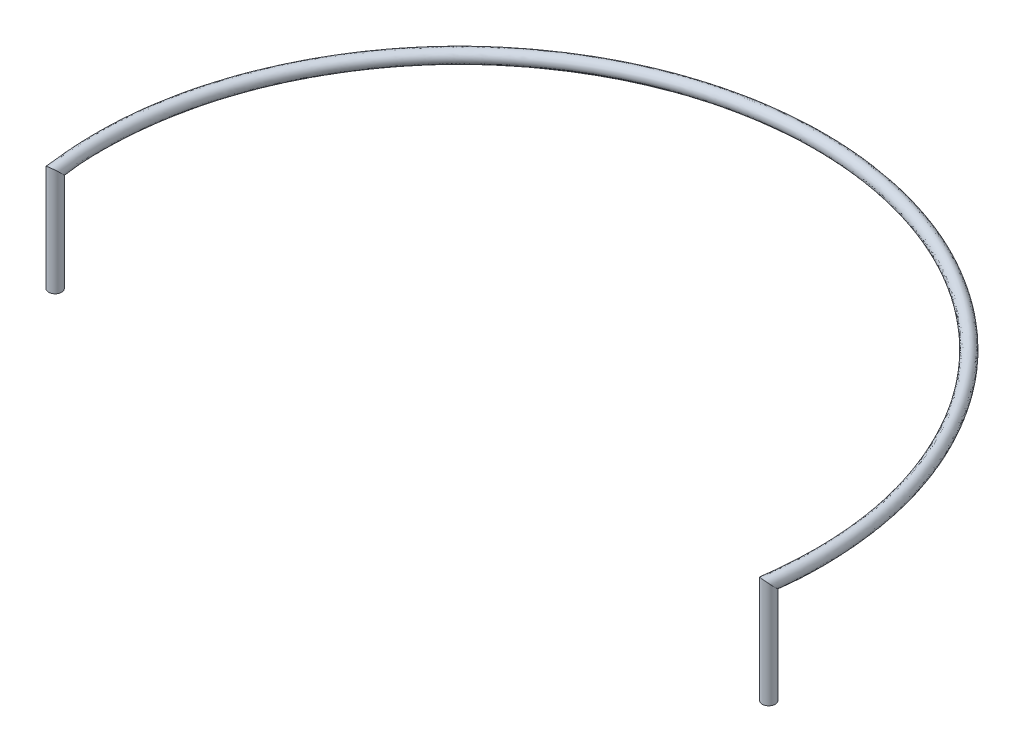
ISO-10303-21;
HEADER;
FILE_DESCRIPTION(('STEP AP214'),'2;1');
FILE_NAME('part.step','',(''),(''),'','','');
FILE_SCHEMA(('AUTOMOTIVE_DESIGN { 1 0 10303 214 1 1 1 1 }'));
ENDSEC;
DATA;
#1=APPLICATION_CONTEXT('core data for automotive mechanical design processes');
#2=APPLICATION_PROTOCOL_DEFINITION('international standard','automotive_design',2000,#1);
#3=PRODUCT_CONTEXT('',#1,'mechanical');
#4=PRODUCT('Part','Part','',(#3));
#5=PRODUCT_RELATED_PRODUCT_CATEGORY('part','',(#4));
#6=PRODUCT_DEFINITION_FORMATION('','',#4);
#7=PRODUCT_DEFINITION_CONTEXT('part definition',#1,'design');
#8=PRODUCT_DEFINITION('design','',#6,#7);
#9=PRODUCT_DEFINITION_SHAPE('','',#8);
#10=(LENGTH_UNIT() NAMED_UNIT(*) SI_UNIT(.MILLI.,.METRE.));
#11=(NAMED_UNIT(*) PLANE_ANGLE_UNIT() SI_UNIT($,.RADIAN.));
#12=(NAMED_UNIT(*) SI_UNIT($,.STERADIAN.) SOLID_ANGLE_UNIT());
#13=UNCERTAINTY_MEASURE_WITH_UNIT(LENGTH_MEASURE(1.E-05),#10,'distance_accuracy_value','');
#14=(GEOMETRIC_REPRESENTATION_CONTEXT(3) GLOBAL_UNCERTAINTY_ASSIGNED_CONTEXT((#13)) GLOBAL_UNIT_ASSIGNED_CONTEXT((#10,
#11,#12)) REPRESENTATION_CONTEXT('',''));
#15=CARTESIAN_POINT('',(0.,0.,0.));
#16=DIRECTION('',(0.,0.,1.));
#17=DIRECTION('',(1.,0.,0.));
#18=AXIS2_PLACEMENT_3D('',#15,#16,#17);
#19=CARTESIAN_POINT('',(-7.,0.360058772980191,0.));
#20=DIRECTION('',(0.,-1.,0.));
#21=DIRECTION('',(0.,0.,-1.));
#22=AXIS2_PLACEMENT_3D('',#19,#20,#21);
#23=CYLINDRICAL_SURFACE('',#22,0.127299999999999);
#24=CARTESIAN_POINT('',(-7.,-2.,0.));
#25=DIRECTION('',(0.,1.,0.));
#26=DIRECTION('',(0.,0.,1.));
#27=AXIS2_PLACEMENT_3D('',#24,#25,#26);
#28=CIRCLE('',#27,0.127299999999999);
#29=CARTESIAN_POINT('',(-7.,-2.,0.127300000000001));
#30=VERTEX_POINT('',#29);
#31=EDGE_CURVE('E42',#30,#30,#28,.T.);
#32=ORIENTED_EDGE('',*,*,#31,.T.);
#33=EDGE_LOOP('',(#32));
#34=FACE_BOUND('',#33,.T.);
#35=CARTESIAN_POINT('',(-7.,0.,0.));
#36=DIRECTION('',(-0.0938637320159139,0.707106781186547,-0.700849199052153));
#37=DIRECTION('',(-0.0938637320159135,-0.707106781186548,-0.700849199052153));
#38=AXIS2_PLACEMENT_3D('',#35,#36,#37);
#39=ELLIPSE('',#38,0.180029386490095,0.127299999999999);
#40=CARTESIAN_POINT('',(-7.0168982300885,-0.127299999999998,-0.126173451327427));
#41=VERTEX_POINT('',#40);
#42=EDGE_CURVE('E11',#41,#41,#39,.T.);
#43=ORIENTED_EDGE('',*,*,#42,.F.);
#44=EDGE_LOOP('',(#43));
#45=FACE_BOUND('',#44,.T.);
#46=ADVANCED_FACE('F36',(#34,#45),#23,.T.);
#47=CARTESIAN_POINT('',(-7.,-2.,0.));
#48=DIRECTION('',(0.,1.,0.));
#49=DIRECTION('',(0.,0.,1.));
#50=AXIS2_PLACEMENT_3D('',#47,#48,#49);
#51=PLANE('',#50);
#52=ORIENTED_EDGE('',*,*,#31,.F.);
#53=EDGE_LOOP('',(#52));
#54=FACE_BOUND('',#53,.T.);
#55=ADVANCED_FACE('F75',(#54),#51,.F.);
#56=CARTESIAN_POINT('',(-7.0168982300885,-0.127299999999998,-0.126173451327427));
#57=CARTESIAN_POINT('',(-7.07808801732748,-0.127299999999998,-0.583057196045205));
#58=CARTESIAN_POINT('',(-7.07988436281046,-0.127299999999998,-1.51699880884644));
#59=CARTESIAN_POINT('',(-6.82578459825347,-0.127299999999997,-2.96096078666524));
#60=CARTESIAN_POINT('',(-6.22992064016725,-0.127299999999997,-4.37638041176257));
#61=CARTESIAN_POINT('',(-5.3262642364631,-0.127299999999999,-5.66846581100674));
#62=CARTESIAN_POINT('',(-4.14902945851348,-0.127299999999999,-6.71926392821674));
#63=CARTESIAN_POINT('',(-2.80896690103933,-0.127299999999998,-7.47752218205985));
#64=CARTESIAN_POINT('',(-1.4033462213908,-0.127299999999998,-7.90581309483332));
#65=CARTESIAN_POINT('',(0.,-0.127299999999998,-8.04552641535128));
#66=CARTESIAN_POINT('',(1.40334622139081,-0.127299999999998,-7.90581309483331));
#67=CARTESIAN_POINT('',(2.80896690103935,-0.127299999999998,-7.47752218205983));
#68=CARTESIAN_POINT('',(4.14902945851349,-0.127299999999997,-6.71926392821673));
#69=CARTESIAN_POINT('',(5.32626423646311,-0.127299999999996,-5.66846581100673));
#70=CARTESIAN_POINT('',(6.22992064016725,-0.127299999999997,-4.37638041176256));
#71=CARTESIAN_POINT('',(6.82578459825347,-0.127299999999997,-2.96096078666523));
#72=CARTESIAN_POINT('',(7.07988436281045,-0.127299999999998,-1.51699880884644));
#73=CARTESIAN_POINT('',(7.07808801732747,-0.127299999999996,-0.583057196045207));
#74=CARTESIAN_POINT('',(7.01689823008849,-0.127299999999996,-0.126173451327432));
#75=CARTESIAN_POINT('',(-7.26924513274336,-0.127299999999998,-0.0923769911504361));
#76=CARTESIAN_POINT('',(-7.33344792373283,-0.127299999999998,-0.571757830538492));
#77=CARTESIAN_POINT('',(-7.33525755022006,-0.127299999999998,-1.53126582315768));
#78=CARTESIAN_POINT('',(-7.07274588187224,-0.127299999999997,-3.03180183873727));
#79=CARTESIAN_POINT('',(-6.45582386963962,-0.127299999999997,-4.49802939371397));
#80=CARTESIAN_POINT('',(-5.51951469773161,-0.127299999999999,-5.8376220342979));
#81=CARTESIAN_POINT('',(-4.29982868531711,-0.127299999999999,-6.92700582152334));
#82=CARTESIAN_POINT('',(-2.91108137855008,-0.127299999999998,-7.71290163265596));
#83=CARTESIAN_POINT('',(-1.45438736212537,-0.127299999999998,-8.15703335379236));
#84=CARTESIAN_POINT('',(-1.98099879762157E-13,-0.127299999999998,-8.30176005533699));
#85=CARTESIAN_POINT('',(1.45438736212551,-0.127299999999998,-8.15703335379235));
#86=CARTESIAN_POINT('',(2.91108137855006,-0.127299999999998,-7.71290163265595));
#87=CARTESIAN_POINT('',(4.29982868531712,-0.127299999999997,-6.92700582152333));
#88=CARTESIAN_POINT('',(5.51951469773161,-0.127299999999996,-5.83762203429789));
#89=CARTESIAN_POINT('',(6.45582386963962,-0.127299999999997,-4.49802939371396));
#90=CARTESIAN_POINT('',(7.07274588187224,-0.127299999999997,-3.03180183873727));
#91=CARTESIAN_POINT('',(7.33525755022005,-0.127299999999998,-1.53126582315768));
#92=CARTESIAN_POINT('',(7.33344792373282,-0.127299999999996,-0.571757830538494));
#93=CARTESIAN_POINT('',(7.26924513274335,-0.127299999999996,-0.0923769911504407));
#94=CARTESIAN_POINT('',(-7.23544867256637,0.127300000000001,0.15996991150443));
#95=CARTESIAN_POINT('',(-7.29965146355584,0.127300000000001,-0.319410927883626));
#96=CARTESIAN_POINT('',(-7.36136854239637,0.127300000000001,-1.33146195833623));
#97=CARTESIAN_POINT('',(-7.11879660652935,0.127300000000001,-2.86703022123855));
#98=CARTESIAN_POINT('',(-6.52338152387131,0.1273,-4.37982398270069));
#99=CARTESIAN_POINT('',(-5.59073604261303,0.127300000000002,-5.75916207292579));
#100=CARTESIAN_POINT('',(-4.3641408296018,0.127300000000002,-6.88291010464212));
#101=CARTESIAN_POINT('',(-2.95903514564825,0.127300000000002,-7.69409382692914));
#102=CARTESIAN_POINT('',(-1.48031235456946,0.127300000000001,-8.15353243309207));
#103=CARTESIAN_POINT('',(-1.98164703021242E-13,0.127300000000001,-8.30345226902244));
#104=CARTESIAN_POINT('',(1.4803123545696,0.127300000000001,-8.15353243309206));
#105=CARTESIAN_POINT('',(2.95903514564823,0.127300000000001,-7.69409382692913));
#106=CARTESIAN_POINT('',(4.36414082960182,0.1273,-6.88291010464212));
#107=CARTESIAN_POINT('',(5.59073604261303,0.127299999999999,-5.75916207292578));
#108=CARTESIAN_POINT('',(6.52338152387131,0.1273,-4.37982398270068));
#109=CARTESIAN_POINT('',(7.11879660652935,0.1273,-2.86703022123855));
#110=CARTESIAN_POINT('',(7.36136854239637,0.127300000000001,-1.33146195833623));
#111=CARTESIAN_POINT('',(7.29965146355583,0.1273,-0.319410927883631));
#112=CARTESIAN_POINT('',(7.23544867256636,0.1273,0.159969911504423));
#113=CARTESIAN_POINT('',(-6.9831017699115,0.127300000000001,0.126173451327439));
#114=CARTESIAN_POINT('',(-7.04579805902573,0.127300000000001,-0.341958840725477));
#115=CARTESIAN_POINT('',(-7.10524714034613,0.127300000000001,-1.31160827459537));
#116=CARTESIAN_POINT('',(-6.8720530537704,0.127300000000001,-2.7978148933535));
#117=CARTESIAN_POINT('',(-6.29741708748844,0.1273,-4.2577179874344));
#118=CARTESIAN_POINT('',(-5.39750216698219,0.127300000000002,-5.59012969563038));
#119=CARTESIAN_POINT('',(-4.21333726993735,0.127300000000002,-6.67513583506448));
#120=CARTESIAN_POINT('',(-2.85692175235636,0.127300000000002,-7.45872255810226));
#121=CARTESIAN_POINT('',(-1.42927096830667,0.127300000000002,-7.90231004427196));
#122=CARTESIAN_POINT('',(0.,0.127300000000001,-8.04721965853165));
#123=CARTESIAN_POINT('',(1.42927096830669,0.127300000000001,-7.90231004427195));
#124=CARTESIAN_POINT('',(2.85692175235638,0.127300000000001,-7.45872255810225));
#125=CARTESIAN_POINT('',(4.21333726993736,0.1273,-6.67513583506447));
#126=CARTESIAN_POINT('',(5.39750216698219,0.1273,-5.59012969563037));
#127=CARTESIAN_POINT('',(6.29741708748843,0.1273,-4.2577179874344));
#128=CARTESIAN_POINT('',(6.8720530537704,0.1273,-2.79781489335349));
#129=CARTESIAN_POINT('',(7.10524714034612,0.127300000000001,-1.31160827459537));
#130=CARTESIAN_POINT('',(7.04579805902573,0.1273,-0.341958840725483));
#131=CARTESIAN_POINT('',(6.9831017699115,0.1273,0.126173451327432));
#132=CARTESIAN_POINT('',(-6.73075486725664,0.127300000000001,0.0923769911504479));
#133=CARTESIAN_POINT('',(-6.79194465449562,0.127300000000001,-0.36450675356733));
#134=CARTESIAN_POINT('',(-6.84912573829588,0.127300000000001,-1.29175459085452));
#135=CARTESIAN_POINT('',(-6.62530950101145,0.127300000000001,-2.72859956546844));
#136=CARTESIAN_POINT('',(-6.07145265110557,0.127300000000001,-4.13561199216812));
#137=CARTESIAN_POINT('',(-5.20426829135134,0.127300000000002,-5.42109731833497));
#138=CARTESIAN_POINT('',(-4.0625337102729,0.127300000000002,-6.46736156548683));
#139=CARTESIAN_POINT('',(-2.75480835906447,0.127300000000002,-7.22335128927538));
#140=CARTESIAN_POINT('',(-1.37822958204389,0.127300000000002,-7.65108765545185));
#141=CARTESIAN_POINT('',(2.15861452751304E-13,0.127300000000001,-7.79098704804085));
#142=CARTESIAN_POINT('',(1.37822958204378,0.127300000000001,-7.65108765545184));
#143=CARTESIAN_POINT('',(2.75480835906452,0.127300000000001,-7.22335128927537));
#144=CARTESIAN_POINT('',(4.0625337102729,0.1273,-6.46736156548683));
#145=CARTESIAN_POINT('',(5.20426829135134,0.1273,-5.42109731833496));
#146=CARTESIAN_POINT('',(6.07145265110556,0.127300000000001,-4.13561199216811));
#147=CARTESIAN_POINT('',(6.62530950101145,0.1273,-2.72859956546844));
#148=CARTESIAN_POINT('',(6.84912573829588,0.127300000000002,-1.29175459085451));
#149=CARTESIAN_POINT('',(6.79194465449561,0.1273,-0.364506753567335));
#150=CARTESIAN_POINT('',(6.73075486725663,0.1273,0.0923769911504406));
#151=CARTESIAN_POINT('',(-6.76455132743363,-0.127299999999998,-0.159969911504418));
#152=CARTESIAN_POINT('',(-6.82272811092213,-0.127299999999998,-0.594356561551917));
#153=CARTESIAN_POINT('',(-6.82451117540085,-0.127299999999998,-1.50273179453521));
#154=CARTESIAN_POINT('',(-6.57882331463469,-0.127299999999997,-2.8901197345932));
#155=CARTESIAN_POINT('',(-6.00401741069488,-0.127299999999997,-4.25473142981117));
#156=CARTESIAN_POINT('',(-5.13301377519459,-0.127299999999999,-5.49930958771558));
#157=CARTESIAN_POINT('',(-3.99823023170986,-0.127299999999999,-6.51152203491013));
#158=CARTESIAN_POINT('',(-2.70685242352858,-0.127299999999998,-7.24214273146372));
#159=CARTESIAN_POINT('',(-1.35230508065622,-0.127299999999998,-7.65459283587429));
#160=CARTESIAN_POINT('',(2.15796629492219E-13,-0.127299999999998,-7.78929277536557));
#161=CARTESIAN_POINT('',(1.35230508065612,-0.127299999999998,-7.65459283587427));
#162=CARTESIAN_POINT('',(2.70685242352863,-0.127299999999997,-7.24214273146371));
#163=CARTESIAN_POINT('',(3.99823023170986,-0.127299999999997,-6.51152203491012));
#164=CARTESIAN_POINT('',(5.1330137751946,-0.127299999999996,-5.49930958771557));
#165=CARTESIAN_POINT('',(6.00401741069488,-0.127299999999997,-4.25473142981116));
#166=CARTESIAN_POINT('',(6.57882331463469,-0.127299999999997,-2.8901197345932));
#167=CARTESIAN_POINT('',(6.82451117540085,-0.127299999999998,-1.50273179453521));
#168=CARTESIAN_POINT('',(6.82272811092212,-0.127299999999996,-0.594356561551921));
#169=CARTESIAN_POINT('',(6.76455132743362,-0.127299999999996,-0.159969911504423));
#170=CARTESIAN_POINT('',(-7.0168982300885,-0.127299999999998,-0.126173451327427));
#171=CARTESIAN_POINT('',(-7.07808801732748,-0.127299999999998,-0.583057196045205));
#172=CARTESIAN_POINT('',(-7.07988436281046,-0.127299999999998,-1.51699880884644));
#173=CARTESIAN_POINT('',(-6.82578459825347,-0.127299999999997,-2.96096078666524));
#174=CARTESIAN_POINT('',(-6.22992064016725,-0.127299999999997,-4.37638041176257));
#175=CARTESIAN_POINT('',(-5.3262642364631,-0.127299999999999,-5.66846581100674));
#176=CARTESIAN_POINT('',(-4.14902945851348,-0.127299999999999,-6.71926392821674));
#177=CARTESIAN_POINT('',(-2.80896690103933,-0.127299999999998,-7.47752218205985));
#178=CARTESIAN_POINT('',(-1.4033462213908,-0.127299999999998,-7.90581309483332));
#179=CARTESIAN_POINT('',(0.,-0.127299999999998,-8.04552641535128));
#180=CARTESIAN_POINT('',(1.40334622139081,-0.127299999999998,-7.90581309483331));
#181=CARTESIAN_POINT('',(2.80896690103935,-0.127299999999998,-7.47752218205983));
#182=CARTESIAN_POINT('',(4.14902945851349,-0.127299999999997,-6.71926392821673));
#183=CARTESIAN_POINT('',(5.32626423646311,-0.127299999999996,-5.66846581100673));
#184=CARTESIAN_POINT('',(6.22992064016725,-0.127299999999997,-4.37638041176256));
#185=CARTESIAN_POINT('',(6.82578459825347,-0.127299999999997,-2.96096078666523));
#186=CARTESIAN_POINT('',(7.07988436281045,-0.127299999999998,-1.51699880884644));
#187=CARTESIAN_POINT('',(7.07808801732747,-0.127299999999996,-0.583057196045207));
#188=CARTESIAN_POINT('',(7.01689823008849,-0.127299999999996,-0.126173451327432));
#189=(BOUNDED_SURFACE() B_SPLINE_SURFACE(3,3,((#56,#57,#58,#59,#60,#61,#62,#63,#64,#65,#66,#67,
#68,#69,#70,#71,#72,#73,#74),(#75,#76,#77,#78,#79,#80,#81,#82,#83,#84,#85,#86,#87,#88,#89,#90,
#91,#92,#93),(#94,#95,#96,#97,#98,#99,#100,#101,#102,#103,#104,#105,#106,#107,#108,#109,#110,
#111,#112),(#113,#114,#115,#116,#117,#118,#119,#120,#121,#122,#123,#124,#125,#126,#127,#128,
#129,#130,#131),(#132,#133,#134,#135,#136,#137,#138,#139,#140,#141,#142,#143,#144,#145,#146,
#147,#148,#149,#150),(#151,#152,#153,#154,#155,#156,#157,#158,#159,#160,#161,#162,#163,#164,
#165,#166,#167,#168,#169),(#170,#171,#172,#173,#174,#175,#176,#177,#178,#179,#180,#181,#182,
#183,#184,#185,#186,#187,#188)),.UNSPECIFIED.,.T.,.F.,.F.) B_SPLINE_SURFACE_WITH_KNOTS((4,3,4),
(4,1,1,1,1,1,1,1,1,1,1,1,1,1,1,1,4),(0.,0.5,1.),(0.,0.0575225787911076,0.119027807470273,
0.183689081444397,0.249943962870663,0.316205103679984,0.380885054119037,0.442424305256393,
0.500000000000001,0.557575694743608,0.619114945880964,0.683794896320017,0.750056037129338,
0.816310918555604,0.880972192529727,0.942477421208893,1.),
.UNSPECIFIED.) GEOMETRIC_REPRESENTATION_ITEM() RATIONAL_B_SPLINE_SURFACE(((1.,1.,1.,1.,1.,1.,1.,
1.,1.,1.,1.,1.,1.,1.,1.,1.,1.,1.,1.),(0.333333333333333,0.333333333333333,0.333333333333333,
0.333333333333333,0.333333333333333,0.333333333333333,0.333333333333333,0.333333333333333,
0.333333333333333,0.333333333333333,0.333333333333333,0.333333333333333,0.333333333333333,
0.333333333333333,0.333333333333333,0.333333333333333,0.333333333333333,0.333333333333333,
0.333333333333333),(0.333333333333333,0.333333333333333,0.333333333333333,0.333333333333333,
0.333333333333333,0.333333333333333,0.333333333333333,0.333333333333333,0.333333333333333,
0.333333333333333,0.333333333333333,0.333333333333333,0.333333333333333,0.333333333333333,
0.333333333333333,0.333333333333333,0.333333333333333,0.333333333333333,0.333333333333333),(1.,
1.,1.,1.,1.,1.,1.,1.,1.,1.,1.,1.,1.,1.,1.,1.,1.,1.,1.),(0.333333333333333,0.333333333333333,
0.333333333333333,0.333333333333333,0.333333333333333,0.333333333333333,0.333333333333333,
0.333333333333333,0.333333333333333,0.333333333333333,0.333333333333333,0.333333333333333,
0.333333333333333,0.333333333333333,0.333333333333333,0.333333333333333,0.333333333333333,
0.333333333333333,0.333333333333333),(0.333333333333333,0.333333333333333,0.333333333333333,
0.333333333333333,0.333333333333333,0.333333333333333,0.333333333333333,0.333333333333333,
0.333333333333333,0.333333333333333,0.333333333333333,0.333333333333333,0.333333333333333,
0.333333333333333,0.333333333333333,0.333333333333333,0.333333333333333,0.333333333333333,
0.333333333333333),(1.,1.,1.,1.,1.,1.,1.,1.,1.,1.,1.,1.,1.,1.,1.,1.,1.,1.,1.))) REPRESENTATION_ITEM('') SURFACE());
#190=CARTESIAN_POINT('',(7.01689823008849,-0.127299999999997,-0.126173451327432));
#191=CARTESIAN_POINT('',(6.76455132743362,-0.127299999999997,-0.159969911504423));
#192=CARTESIAN_POINT('',(6.73075486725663,0.1273,0.0923769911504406));
#193=CARTESIAN_POINT('',(6.9831017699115,0.127299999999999,0.126173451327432));
#194=CARTESIAN_POINT('',(7.23544867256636,0.127299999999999,0.159969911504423));
#195=CARTESIAN_POINT('',(7.26924513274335,-0.127299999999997,-0.0923769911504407));
#196=CARTESIAN_POINT('',(7.01689823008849,-0.127299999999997,-0.126173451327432));
#197=(BOUNDED_CURVE() B_SPLINE_CURVE(3,(#190,#191,#192,#193,#194,#195,#196),.UNSPECIFIED.,.T.,
.F.) B_SPLINE_CURVE_WITH_KNOTS((4,3,4),(0.,0.5,1.),
.UNSPECIFIED.) CURVE() GEOMETRIC_REPRESENTATION_ITEM() RATIONAL_B_SPLINE_CURVE((1.,
0.333333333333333,0.333333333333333,1.,0.333333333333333,0.333333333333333,1.)) REPRESENTATION_ITEM(''));
#198=CARTESIAN_POINT('',(7.01689823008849,-0.127299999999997,-0.126173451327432));
#199=VERTEX_POINT('',#198);
#200=EDGE_CURVE('E50',#199,#199,#197,.T.);
#201=ORIENTED_EDGE('',*,*,#42,.T.);
#202=EDGE_LOOP('',(#201));
#203=FACE_BOUND('',#202,.T.);
#204=ORIENTED_EDGE('',*,*,#200,.T.);
#205=EDGE_LOOP('',(#204));
#206=FACE_BOUND('',#205,.T.);
#207=ADVANCED_FACE('F61',(#203,#206),#189,.T.);
#208=CARTESIAN_POINT('',(6.9831017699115,-2.,0.126173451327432));
#209=DIRECTION('',(0.,-1.,0.));
#210=DIRECTION('',(0.,0.,-1.));
#211=AXIS2_PLACEMENT_3D('',#208,#209,#210);
#212=PLANE('',#211);
#213=CARTESIAN_POINT('',(6.99999999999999,-2.,0.));
#214=DIRECTION('',(0.,-1.,0.));
#215=DIRECTION('',(0.,0.,-1.));
#216=AXIS2_PLACEMENT_3D('',#213,#214,#215);
#217=CIRCLE('',#216,0.127299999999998);
#218=CARTESIAN_POINT('',(6.99999999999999,-2.,-0.127299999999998));
#219=VERTEX_POINT('',#218);
#220=EDGE_CURVE('E46',#219,#219,#217,.T.);
#221=ORIENTED_EDGE('',*,*,#220,.T.);
#222=EDGE_LOOP('',(#221));
#223=FACE_BOUND('',#222,.T.);
#224=ADVANCED_FACE('F66',(#223),#212,.T.);
#225=CARTESIAN_POINT('',(7.01689823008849,-0.127299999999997,-0.126173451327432));
#226=CARTESIAN_POINT('',(7.01689823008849,-2.,-0.126173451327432));
#227=CARTESIAN_POINT('',(6.76455132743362,-0.127299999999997,-0.159969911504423));
#228=CARTESIAN_POINT('',(6.76455132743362,-2.,-0.159969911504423));
#229=CARTESIAN_POINT('',(6.73075486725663,0.1273,0.0923769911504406));
#230=CARTESIAN_POINT('',(6.73075486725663,-2.,0.0923769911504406));
#231=CARTESIAN_POINT('',(6.9831017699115,0.127299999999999,0.126173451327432));
#232=CARTESIAN_POINT('',(6.9831017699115,-2.,0.126173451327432));
#233=CARTESIAN_POINT('',(7.23544867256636,0.127299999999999,0.159969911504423));
#234=CARTESIAN_POINT('',(7.23544867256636,-2.,0.159969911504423));
#235=CARTESIAN_POINT('',(7.26924513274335,-0.127299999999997,-0.0923769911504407));
#236=CARTESIAN_POINT('',(7.26924513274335,-2.,-0.0923769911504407));
#237=CARTESIAN_POINT('',(7.01689823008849,-0.127299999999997,-0.126173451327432));
#238=CARTESIAN_POINT('',(7.01689823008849,-2.,-0.126173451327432));
#239=(BOUNDED_SURFACE() B_SPLINE_SURFACE(3,1,((#225,#226),(#227,#228),(#229,#230),(#231,#232),
(#233,#234),(#235,#236),(#237,#238)),.UNSPECIFIED.,.T.,.F.,.F.) B_SPLINE_SURFACE_WITH_KNOTS((4,
3,4),(2,2),(0.,0.5,1.),(0.,1.),
.UNSPECIFIED.) GEOMETRIC_REPRESENTATION_ITEM() RATIONAL_B_SPLINE_SURFACE(((1.,1.),
(0.333333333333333,0.333333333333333),(0.333333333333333,0.333333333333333),(1.,1.),
(0.333333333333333,0.333333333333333),(0.333333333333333,0.333333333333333),(1.,1.))) REPRESENTATION_ITEM('') SURFACE());
#240=ORIENTED_EDGE('',*,*,#200,.F.);
#241=EDGE_LOOP('',(#240));
#242=FACE_BOUND('',#241,.T.);
#243=ORIENTED_EDGE('',*,*,#220,.F.);
#244=EDGE_LOOP('',(#243));
#245=FACE_BOUND('',#244,.T.);
#246=ADVANCED_FACE('F63',(#242,#245),#239,.F.);
#247=CLOSED_SHELL('',(#46,#55,#207,#224,#246));
#248=MANIFOLD_SOLID_BREP('B2',#247);
#249=ADVANCED_BREP_SHAPE_REPRESENTATION('',(#18,#248),#14);
#250=SHAPE_DEFINITION_REPRESENTATION(#9,#249);
ENDSEC;
END-ISO-10303-21;
